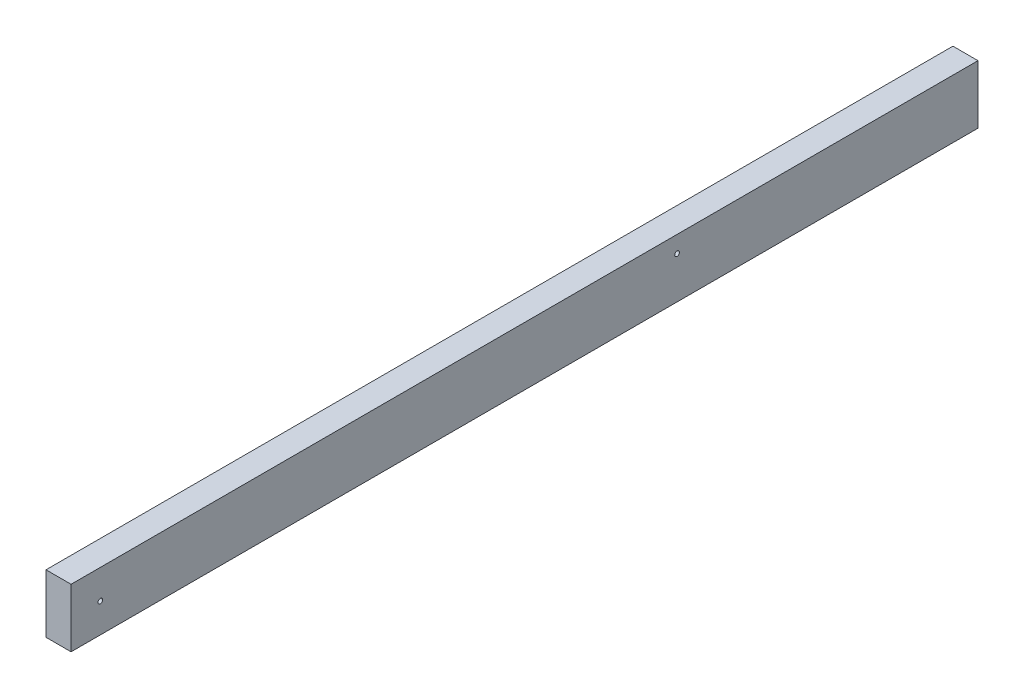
from build123d import *

# Parameters (mm, degrees)
SKETCH1_W                       = 38.1
SKETCH1_H                       = 88.9
BOSS_EXTRUDE1_DEPTH             = 1377.95
F_9_32_0_28125_DIAMETER_HOLE1_D = 7.14375


with BuildPart() as part:
    # Sketch1 → Boss-Extrude1 (new body)
    with BuildSketch(Plane.XY):
        Rectangle(SKETCH1_W, SKETCH1_H)
    extrude(amount=BOSS_EXTRUDE1_DEPTH)

    # 9_32 _0.28125_ Diameter Hole1 (through all)
    with Locations(Plane(origin=(19.05, 0, 0), x_dir=(0, 0, -1), z_dir=(1, 0, 0))):
        with Locations((-1333.5, 0), (-457.2, 19.05)):
            Hole(F_9_32_0_28125_DIAMETER_HOLE1_D / 2)


solid = part.part
